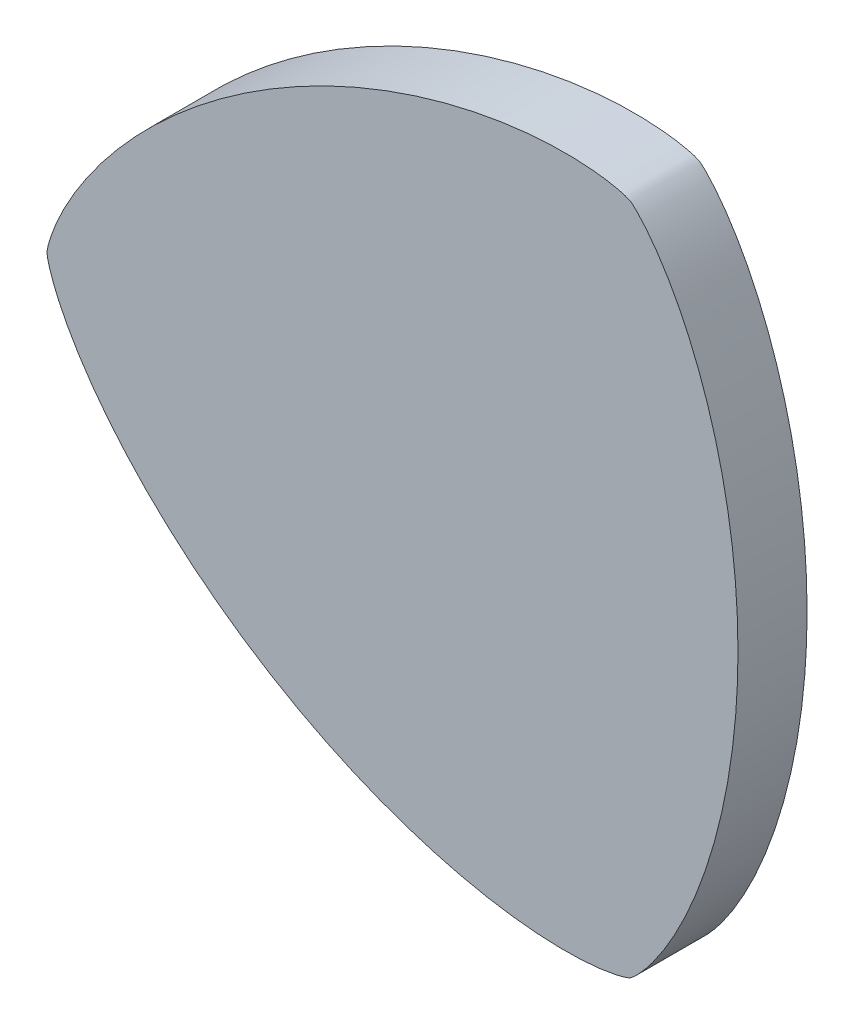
ISO-10303-21;
HEADER;
FILE_DESCRIPTION(('STEP AP214'),'2;1');
FILE_NAME('part.step','',(''),(''),'','','');
FILE_SCHEMA(('AUTOMOTIVE_DESIGN { 1 0 10303 214 1 1 1 1 }'));
ENDSEC;
DATA;
#1=APPLICATION_CONTEXT('core data for automotive mechanical design processes');
#2=APPLICATION_PROTOCOL_DEFINITION('international standard','automotive_design',2000,#1);
#3=PRODUCT_CONTEXT('',#1,'mechanical');
#4=PRODUCT('Part','Part','',(#3));
#5=PRODUCT_RELATED_PRODUCT_CATEGORY('part','',(#4));
#6=PRODUCT_DEFINITION_FORMATION('','',#4);
#7=PRODUCT_DEFINITION_CONTEXT('part definition',#1,'design');
#8=PRODUCT_DEFINITION('design','',#6,#7);
#9=PRODUCT_DEFINITION_SHAPE('','',#8);
#10=(LENGTH_UNIT() NAMED_UNIT(*) SI_UNIT(.MILLI.,.METRE.));
#11=(NAMED_UNIT(*) PLANE_ANGLE_UNIT() SI_UNIT($,.RADIAN.));
#12=(NAMED_UNIT(*) SI_UNIT($,.STERADIAN.) SOLID_ANGLE_UNIT());
#13=UNCERTAINTY_MEASURE_WITH_UNIT(LENGTH_MEASURE(1.E-05),#10,'distance_accuracy_value','');
#14=(GEOMETRIC_REPRESENTATION_CONTEXT(3) GLOBAL_UNCERTAINTY_ASSIGNED_CONTEXT((#13)) GLOBAL_UNIT_ASSIGNED_CONTEXT((#10,
#11,#12)) REPRESENTATION_CONTEXT('',''));
#15=CARTESIAN_POINT('',(0.,0.,0.));
#16=DIRECTION('',(0.,0.,1.));
#17=DIRECTION('',(1.,0.,0.));
#18=AXIS2_PLACEMENT_3D('',#15,#16,#17);
#19=CARTESIAN_POINT('',(43.75,0.,10.));
#20=CARTESIAN_POINT('',(43.75,3.46212634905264,10.));
#21=CARTESIAN_POINT('',(43.400250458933,10.2183292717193,10.));
#22=CARTESIAN_POINT('',(41.8947745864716,19.8449914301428,10.));
#23=CARTESIAN_POINT('',(39.6418998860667,28.3668744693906,10.));
#24=CARTESIAN_POINT('',(36.9761272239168,35.4159727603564,10.));
#25=CARTESIAN_POINT('',(34.2737589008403,40.8095143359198,10.));
#26=CARTESIAN_POINT('',(31.8841369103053,44.5676984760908,10.));
#27=CARTESIAN_POINT('',(30.0556991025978,46.8804327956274,10.));
#28=CARTESIAN_POINT('',(28.8976397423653,48.0877901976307,10.));
#29=CARTESIAN_POINT('',(28.3313325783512,48.5652547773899,10.));
#30=CARTESIAN_POINT('',(28.126623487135,48.716740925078,10.));
#31=CARTESIAN_POINT('',(27.8930780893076,48.8182811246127,10.));
#32=CARTESIAN_POINT('',(27.1964280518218,49.0699852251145,10.));
#33=CARTESIAN_POINT('',(25.5717961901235,49.4692153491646,10.));
#34=CARTESIAN_POINT('',(22.654690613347,49.8963217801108,10.));
#35=CARTESIAN_POINT('',(18.2051966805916,50.0867030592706,10.));
#36=CARTESIAN_POINT('',(12.183068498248,49.7302518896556,10.));
#37=CARTESIAN_POINT('',(4.74548397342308,48.5143295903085,10.));
#38=CARTESIAN_POINT('',(-3.7611205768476,46.2044347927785,10.));
#39=CARTESIAN_POINT('',(-12.8507924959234,42.6948840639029,10.));
#40=CARTESIAN_POINT('',(-21.9646122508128,38.0438243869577,10.));
#41=CARTESIAN_POINT('',(-30.5494579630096,32.4765547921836,10.));
#42=CARTESIAN_POINT('',(-38.1336540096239,26.3594433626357,10.));
#43=CARTESIAN_POINT('',(-44.3873838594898,20.147455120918,10.));
#44=CARTESIAN_POINT('',(-49.1591957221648,14.3142791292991,10.));
#45=CARTESIAN_POINT('',(-52.4789555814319,9.27718872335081,10.));
#46=CARTESIAN_POINT('',(-54.5388275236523,5.32862330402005,10.));
#47=CARTESIAN_POINT('',(-55.6274952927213,2.58878255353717,10.));
#48=CARTESIAN_POINT('',(-56.0940677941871,0.982195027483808,10.));
#49=CARTESIAN_POINT('',(-56.2244106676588,0.253026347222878,10.));
#50=CARTESIAN_POINT('',(-56.25324697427,0.,10.));
#51=CARTESIAN_POINT('',(-56.2244106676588,-0.253026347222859,10.));
#52=CARTESIAN_POINT('',(-56.0940677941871,-0.982195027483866,10.));
#53=CARTESIAN_POINT('',(-55.6274952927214,-2.58878255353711,10.));
#54=CARTESIAN_POINT('',(-54.5388275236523,-5.32862330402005,10.));
#55=CARTESIAN_POINT('',(-52.4789555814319,-9.27718872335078,10.));
#56=CARTESIAN_POINT('',(-49.1591957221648,-14.3142791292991,10.));
#57=CARTESIAN_POINT('',(-44.3873838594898,-20.1474551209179,10.));
#58=CARTESIAN_POINT('',(-38.133654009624,-26.3594433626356,10.));
#59=CARTESIAN_POINT('',(-30.5494579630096,-32.4765547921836,10.));
#60=CARTESIAN_POINT('',(-21.9646122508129,-38.0438243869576,10.));
#61=CARTESIAN_POINT('',(-12.8507924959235,-42.6948840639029,10.));
#62=CARTESIAN_POINT('',(-3.76112057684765,-46.2044347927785,10.));
#63=CARTESIAN_POINT('',(4.74548397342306,-48.5143295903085,10.));
#64=CARTESIAN_POINT('',(12.1830684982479,-49.7302518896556,10.));
#65=CARTESIAN_POINT('',(18.2051966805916,-50.0867030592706,10.));
#66=CARTESIAN_POINT('',(22.654690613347,-49.8963217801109,10.));
#67=CARTESIAN_POINT('',(25.5717961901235,-49.4692153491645,10.));
#68=CARTESIAN_POINT('',(27.1964280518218,-49.0699852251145,10.));
#69=CARTESIAN_POINT('',(27.8930780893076,-48.8182811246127,10.));
#70=CARTESIAN_POINT('',(28.126623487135,-48.716740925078,10.));
#71=CARTESIAN_POINT('',(28.3313325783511,-48.5652547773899,10.));
#72=CARTESIAN_POINT('',(28.8976397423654,-48.0877901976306,10.));
#73=CARTESIAN_POINT('',(30.0556991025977,-46.8804327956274,10.));
#74=CARTESIAN_POINT('',(31.8841369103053,-44.5676984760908,10.));
#75=CARTESIAN_POINT('',(34.2737589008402,-40.8095143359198,10.));
#76=CARTESIAN_POINT('',(36.9761272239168,-35.4159727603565,10.));
#77=CARTESIAN_POINT('',(39.6418998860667,-28.3668744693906,10.));
#78=CARTESIAN_POINT('',(41.8947745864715,-19.8449914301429,10.));
#79=CARTESIAN_POINT('',(43.400250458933,-10.2183292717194,10.));
#80=CARTESIAN_POINT('',(43.75,-3.46212634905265,10.));
#81=CARTESIAN_POINT('',(43.75,0.,10.));
#82=B_SPLINE_CURVE_WITH_KNOTS('',3,(#19,#20,#21,#22,#23,#24,#25,#26,#27,#28,#29,#30,#31,#32,#33,
#34,#35,#36,#37,#38,#39,#40,#41,#42,#43,#44,#45,#46,#47,#48,#49,#50,#51,#52,#53,#54,#55,#56,#57,
#58,#59,#60,#61,#62,#63,#64,#65,#66,#67,#68,#69,#70,#71,#72,#73,#74,#75,#76,#77,#78,#79,#80,
#81),.UNSPECIFIED.,.T.,.F.,(4,1,1,1,1,1,1,1,1,1,1,1,1,1,1,1,1,1,1,1,1,1,1,1,1,1,1,1,1,1,1,1,1,1,
1,1,1,1,1,1,1,1,1,1,1,1,1,1,1,1,1,1,1,1,1,1,1,1,1,1,4),(0.,0.0330604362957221,
0.0645161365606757,0.0929194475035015,0.117121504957,0.136384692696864,0.150454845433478,
0.159586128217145,0.164516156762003,0.166393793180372,0.166666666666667,0.166939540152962,
0.16881717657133,0.173747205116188,0.182878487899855,0.196948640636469,0.216211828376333,
0.240413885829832,0.268817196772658,0.300272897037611,0.333333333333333,0.366393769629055,
0.397849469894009,0.426252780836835,0.450454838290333,0.469718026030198,0.483788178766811,
0.492919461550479,0.497849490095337,0.499727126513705,0.5,0.500272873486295,0.502150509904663,
0.507080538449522,0.516211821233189,0.530281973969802,0.549545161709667,0.573747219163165,
0.602150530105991,0.633606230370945,0.666666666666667,0.699727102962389,0.731182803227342,
0.759586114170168,0.783788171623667,0.803051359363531,0.817121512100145,0.826252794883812,
0.83118282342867,0.833060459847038,0.833333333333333,0.833606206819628,0.835483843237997,
0.840413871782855,0.849545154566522,0.863615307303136,0.882878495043,0.907080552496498,
0.935483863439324,0.966939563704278,1.),.UNSPECIFIED.);
#83=DIRECTION('',(0.,0.,-1.));
#84=VECTOR('',#83,1.);
#85=SURFACE_OF_LINEAR_EXTRUSION('',#82,#84);
#86=CARTESIAN_POINT('',(43.75,0.,10.));
#87=VERTEX_POINT('',#86);
#88=EDGE_CURVE('E10',#87,#87,#82,.T.);
#89=ORIENTED_EDGE('',*,*,#88,.F.);
#90=EDGE_LOOP('',(#89));
#91=FACE_BOUND('',#90,.T.);
#92=CARTESIAN_POINT('',(43.75,0.,0.));
#93=CARTESIAN_POINT('',(43.75,3.46212634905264,0.));
#94=CARTESIAN_POINT('',(43.400250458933,10.2183292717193,0.));
#95=CARTESIAN_POINT('',(41.8947745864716,19.8449914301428,0.));
#96=CARTESIAN_POINT('',(39.6418998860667,28.3668744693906,0.));
#97=CARTESIAN_POINT('',(36.9761272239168,35.4159727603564,0.));
#98=CARTESIAN_POINT('',(34.2737589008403,40.8095143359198,0.));
#99=CARTESIAN_POINT('',(31.8841369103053,44.5676984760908,0.));
#100=CARTESIAN_POINT('',(30.0556991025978,46.8804327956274,0.));
#101=CARTESIAN_POINT('',(28.8976397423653,48.0877901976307,0.));
#102=CARTESIAN_POINT('',(28.3313325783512,48.5652547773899,0.));
#103=CARTESIAN_POINT('',(28.126623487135,48.716740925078,0.));
#104=CARTESIAN_POINT('',(27.8930780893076,48.8182811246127,0.));
#105=CARTESIAN_POINT('',(27.1964280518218,49.0699852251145,0.));
#106=CARTESIAN_POINT('',(25.5717961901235,49.4692153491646,0.));
#107=CARTESIAN_POINT('',(22.654690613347,49.8963217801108,0.));
#108=CARTESIAN_POINT('',(18.2051966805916,50.0867030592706,0.));
#109=CARTESIAN_POINT('',(12.183068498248,49.7302518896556,0.));
#110=CARTESIAN_POINT('',(4.74548397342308,48.5143295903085,0.));
#111=CARTESIAN_POINT('',(-3.7611205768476,46.2044347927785,0.));
#112=CARTESIAN_POINT('',(-12.8507924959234,42.6948840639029,0.));
#113=CARTESIAN_POINT('',(-21.9646122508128,38.0438243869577,0.));
#114=CARTESIAN_POINT('',(-30.5494579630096,32.4765547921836,0.));
#115=CARTESIAN_POINT('',(-38.1336540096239,26.3594433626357,0.));
#116=CARTESIAN_POINT('',(-44.3873838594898,20.147455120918,0.));
#117=CARTESIAN_POINT('',(-49.1591957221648,14.3142791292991,0.));
#118=CARTESIAN_POINT('',(-52.4789555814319,9.27718872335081,0.));
#119=CARTESIAN_POINT('',(-54.5388275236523,5.32862330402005,0.));
#120=CARTESIAN_POINT('',(-55.6274952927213,2.58878255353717,0.));
#121=CARTESIAN_POINT('',(-56.0940677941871,0.982195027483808,0.));
#122=CARTESIAN_POINT('',(-56.2244106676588,0.253026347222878,0.));
#123=CARTESIAN_POINT('',(-56.25324697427,0.,0.));
#124=CARTESIAN_POINT('',(-56.2244106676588,-0.253026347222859,0.));
#125=CARTESIAN_POINT('',(-56.0940677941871,-0.982195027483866,0.));
#126=CARTESIAN_POINT('',(-55.6274952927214,-2.58878255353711,0.));
#127=CARTESIAN_POINT('',(-54.5388275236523,-5.32862330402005,0.));
#128=CARTESIAN_POINT('',(-52.4789555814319,-9.27718872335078,0.));
#129=CARTESIAN_POINT('',(-49.1591957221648,-14.3142791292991,0.));
#130=CARTESIAN_POINT('',(-44.3873838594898,-20.1474551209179,0.));
#131=CARTESIAN_POINT('',(-38.133654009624,-26.3594433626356,0.));
#132=CARTESIAN_POINT('',(-30.5494579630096,-32.4765547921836,0.));
#133=CARTESIAN_POINT('',(-21.9646122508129,-38.0438243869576,0.));
#134=CARTESIAN_POINT('',(-12.8507924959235,-42.6948840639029,0.));
#135=CARTESIAN_POINT('',(-3.76112057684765,-46.2044347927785,0.));
#136=CARTESIAN_POINT('',(4.74548397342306,-48.5143295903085,0.));
#137=CARTESIAN_POINT('',(12.1830684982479,-49.7302518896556,0.));
#138=CARTESIAN_POINT('',(18.2051966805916,-50.0867030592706,0.));
#139=CARTESIAN_POINT('',(22.654690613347,-49.8963217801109,0.));
#140=CARTESIAN_POINT('',(25.5717961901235,-49.4692153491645,0.));
#141=CARTESIAN_POINT('',(27.1964280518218,-49.0699852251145,0.));
#142=CARTESIAN_POINT('',(27.8930780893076,-48.8182811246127,0.));
#143=CARTESIAN_POINT('',(28.126623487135,-48.716740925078,0.));
#144=CARTESIAN_POINT('',(28.3313325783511,-48.5652547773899,0.));
#145=CARTESIAN_POINT('',(28.8976397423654,-48.0877901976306,0.));
#146=CARTESIAN_POINT('',(30.0556991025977,-46.8804327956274,0.));
#147=CARTESIAN_POINT('',(31.8841369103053,-44.5676984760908,0.));
#148=CARTESIAN_POINT('',(34.2737589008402,-40.8095143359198,0.));
#149=CARTESIAN_POINT('',(36.9761272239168,-35.4159727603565,0.));
#150=CARTESIAN_POINT('',(39.6418998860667,-28.3668744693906,0.));
#151=CARTESIAN_POINT('',(41.8947745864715,-19.8449914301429,0.));
#152=CARTESIAN_POINT('',(43.400250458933,-10.2183292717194,0.));
#153=CARTESIAN_POINT('',(43.75,-3.46212634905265,0.));
#154=CARTESIAN_POINT('',(43.75,0.,0.));
#155=B_SPLINE_CURVE_WITH_KNOTS('',3,(#92,#93,#94,#95,#96,#97,#98,#99,#100,#101,#102,#103,#104,
#105,#106,#107,#108,#109,#110,#111,#112,#113,#114,#115,#116,#117,#118,#119,#120,#121,#122,#123,
#124,#125,#126,#127,#128,#129,#130,#131,#132,#133,#134,#135,#136,#137,#138,#139,#140,#141,#142,
#143,#144,#145,#146,#147,#148,#149,#150,#151,#152,#153,#154),.UNSPECIFIED.,.T.,.F.,(4,1,1,1,1,1,
1,1,1,1,1,1,1,1,1,1,1,1,1,1,1,1,1,1,1,1,1,1,1,1,1,1,1,1,1,1,1,1,1,1,1,1,1,1,1,1,1,1,1,1,1,1,1,1,
1,1,1,1,1,1,4),(0.,0.0330604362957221,0.0645161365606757,0.0929194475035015,0.117121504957,
0.136384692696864,0.150454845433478,0.159586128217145,0.164516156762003,0.166393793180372,
0.166666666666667,0.166939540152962,0.16881717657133,0.173747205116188,0.182878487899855,
0.196948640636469,0.216211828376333,0.240413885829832,0.268817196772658,0.300272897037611,
0.333333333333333,0.366393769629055,0.397849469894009,0.426252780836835,0.450454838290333,
0.469718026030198,0.483788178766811,0.492919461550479,0.497849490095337,0.499727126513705,0.5,
0.500272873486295,0.502150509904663,0.507080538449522,0.516211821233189,0.530281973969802,
0.549545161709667,0.573747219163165,0.602150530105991,0.633606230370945,0.666666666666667,
0.699727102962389,0.731182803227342,0.759586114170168,0.783788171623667,0.803051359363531,
0.817121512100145,0.826252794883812,0.83118282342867,0.833060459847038,0.833333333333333,
0.833606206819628,0.835483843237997,0.840413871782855,0.849545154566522,0.863615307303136,
0.882878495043,0.907080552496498,0.935483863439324,0.966939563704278,1.),.UNSPECIFIED.);
#156=CARTESIAN_POINT('',(43.75,0.,0.));
#157=VERTEX_POINT('',#156);
#158=EDGE_CURVE('E42',#157,#157,#155,.T.);
#159=ORIENTED_EDGE('',*,*,#158,.T.);
#160=EDGE_LOOP('',(#159));
#161=FACE_BOUND('',#160,.T.);
#162=ADVANCED_FACE('F33',(#91,#161),#85,.F.);
#163=CARTESIAN_POINT('',(-56.25,0.,10.));
#164=DIRECTION('',(0.,0.,-1.));
#165=DIRECTION('',(-1.,0.,0.));
#166=AXIS2_PLACEMENT_3D('',#163,#164,#165);
#167=PLANE('',#166);
#168=ORIENTED_EDGE('',*,*,#88,.T.);
#169=EDGE_LOOP('',(#168));
#170=FACE_BOUND('',#169,.T.);
#171=ADVANCED_FACE('F56',(#170),#167,.F.);
#172=CARTESIAN_POINT('',(-56.25,0.,0.));
#173=DIRECTION('',(0.,0.,-1.));
#174=DIRECTION('',(-1.,0.,0.));
#175=AXIS2_PLACEMENT_3D('',#172,#173,#174);
#176=PLANE('',#175);
#177=ORIENTED_EDGE('',*,*,#158,.F.);
#178=EDGE_LOOP('',(#177));
#179=FACE_BOUND('',#178,.T.);
#180=ADVANCED_FACE('F54',(#179),#176,.T.);
#181=CLOSED_SHELL('',(#162,#171,#180));
#182=MANIFOLD_SOLID_BREP('B2',#181);
#183=ADVANCED_BREP_SHAPE_REPRESENTATION('',(#18,#182),#14);
#184=SHAPE_DEFINITION_REPRESENTATION(#9,#183);
ENDSEC;
END-ISO-10303-21;
